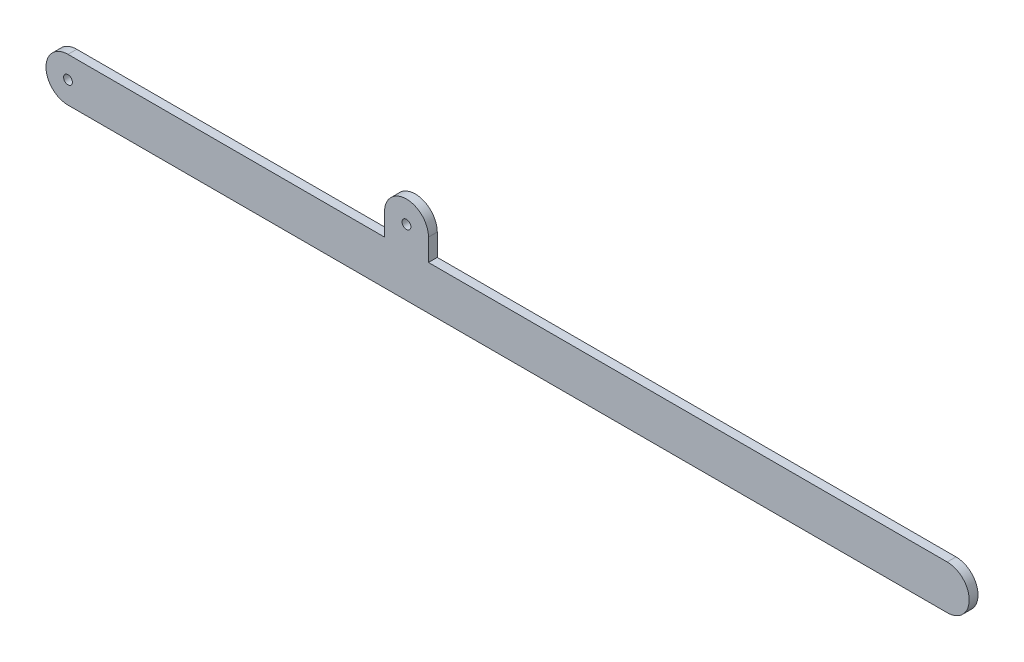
ISO-10303-21;
HEADER;
FILE_DESCRIPTION(('STEP AP214'),'2;1');
FILE_NAME('part.step','',(''),(''),'','','');
FILE_SCHEMA(('AUTOMOTIVE_DESIGN { 1 0 10303 214 1 1 1 1 }'));
ENDSEC;
DATA;
#1=APPLICATION_CONTEXT('core data for automotive mechanical design processes');
#2=APPLICATION_PROTOCOL_DEFINITION('international standard','automotive_design',2000,#1);
#3=PRODUCT_CONTEXT('',#1,'mechanical');
#4=PRODUCT('Part','Part','',(#3));
#5=PRODUCT_RELATED_PRODUCT_CATEGORY('part','',(#4));
#6=PRODUCT_DEFINITION_FORMATION('','',#4);
#7=PRODUCT_DEFINITION_CONTEXT('part definition',#1,'design');
#8=PRODUCT_DEFINITION('design','',#6,#7);
#9=PRODUCT_DEFINITION_SHAPE('','',#8);
#10=(LENGTH_UNIT() NAMED_UNIT(*) SI_UNIT(.MILLI.,.METRE.));
#11=(NAMED_UNIT(*) PLANE_ANGLE_UNIT() SI_UNIT($,.RADIAN.));
#12=(NAMED_UNIT(*) SI_UNIT($,.STERADIAN.) SOLID_ANGLE_UNIT());
#13=UNCERTAINTY_MEASURE_WITH_UNIT(LENGTH_MEASURE(1.E-05),#10,'distance_accuracy_value','');
#14=(GEOMETRIC_REPRESENTATION_CONTEXT(3) GLOBAL_UNCERTAINTY_ASSIGNED_CONTEXT((#13)) GLOBAL_UNIT_ASSIGNED_CONTEXT((#10,
#11,#12)) REPRESENTATION_CONTEXT('',''));
#15=CARTESIAN_POINT('',(0.,0.,0.));
#16=DIRECTION('',(0.,0.,1.));
#17=DIRECTION('',(1.,0.,0.));
#18=AXIS2_PLACEMENT_3D('',#15,#16,#17);
#19=CARTESIAN_POINT('',(0.,-25.,10.));
#20=DIRECTION('',(0.,1.,0.));
#21=DIRECTION('',(0.,0.,1.));
#22=AXIS2_PLACEMENT_3D('',#19,#20,#21);
#23=PLANE('',#22);
#24=DIRECTION('',(1.,0.,0.));
#25=VECTOR('',#24,1.);
#26=CARTESIAN_POINT('',(0.,-25.,0.));
#27=LINE('',#26,#25);
#28=CARTESIAN_POINT('',(0.,-25.,0.));
#29=VERTEX_POINT('',#28);
#30=CARTESIAN_POINT('',(1000.,-25.,0.));
#31=VERTEX_POINT('',#30);
#32=EDGE_CURVE('E126',#29,#31,#27,.T.);
#33=ORIENTED_EDGE('',*,*,#32,.T.);
#34=DIRECTION('',(0.,0.,-1.));
#35=VECTOR('',#34,1.);
#36=CARTESIAN_POINT('',(1000.,-25.,10.));
#37=LINE('',#36,#35);
#38=CARTESIAN_POINT('',(1000.,-25.,10.));
#39=VERTEX_POINT('',#38);
#40=EDGE_CURVE('E11',#39,#31,#37,.T.);
#41=ORIENTED_EDGE('',*,*,#40,.F.);
#42=DIRECTION('',(1.,0.,0.));
#43=VECTOR('',#42,1.);
#44=CARTESIAN_POINT('',(0.,-25.,10.));
#45=LINE('',#44,#43);
#46=CARTESIAN_POINT('',(0.,-25.,10.));
#47=VERTEX_POINT('',#46);
#48=EDGE_CURVE('E145',#47,#39,#45,.T.);
#49=ORIENTED_EDGE('',*,*,#48,.F.);
#50=DIRECTION('',(0.,0.,-1.));
#51=VECTOR('',#50,1.);
#52=CARTESIAN_POINT('',(0.,-25.,10.));
#53=LINE('',#52,#51);
#54=EDGE_CURVE('E122',#47,#29,#53,.T.);
#55=ORIENTED_EDGE('',*,*,#54,.T.);
#56=EDGE_LOOP('',(#33,#41,#49,#55));
#57=FACE_BOUND('',#56,.T.);
#58=ADVANCED_FACE('F32',(#57),#23,.F.);
#59=CARTESIAN_POINT('',(1000.,0.,10.));
#60=DIRECTION('',(0.,0.,-1.));
#61=DIRECTION('',(-1.,0.,0.));
#62=AXIS2_PLACEMENT_3D('',#59,#60,#61);
#63=CYLINDRICAL_SURFACE('',#62,25.);
#64=CARTESIAN_POINT('',(1000.,0.,0.));
#65=DIRECTION('',(0.,0.,1.));
#66=DIRECTION('',(1.,0.,0.));
#67=AXIS2_PLACEMENT_3D('',#64,#65,#66);
#68=CIRCLE('',#67,25.);
#69=CARTESIAN_POINT('',(1000.,25.,0.));
#70=VERTEX_POINT('',#69);
#71=EDGE_CURVE('E129',#31,#70,#68,.T.);
#72=ORIENTED_EDGE('',*,*,#71,.T.);
#73=DIRECTION('',(0.,0.,-1.));
#74=VECTOR('',#73,1.);
#75=CARTESIAN_POINT('',(1000.,25.,10.));
#76=LINE('',#75,#74);
#77=CARTESIAN_POINT('',(1000.,25.,10.));
#78=VERTEX_POINT('',#77);
#79=EDGE_CURVE('E40',#78,#70,#76,.T.);
#80=ORIENTED_EDGE('',*,*,#79,.F.);
#81=CARTESIAN_POINT('',(1000.,0.,10.));
#82=DIRECTION('',(0.,0.,1.));
#83=DIRECTION('',(1.,0.,0.));
#84=AXIS2_PLACEMENT_3D('',#81,#82,#83);
#85=CIRCLE('',#84,25.);
#86=EDGE_CURVE('E87',#39,#78,#85,.T.);
#87=ORIENTED_EDGE('',*,*,#86,.F.);
#88=ORIENTED_EDGE('',*,*,#40,.T.);
#89=EDGE_LOOP('',(#72,#80,#87,#88));
#90=FACE_BOUND('',#89,.T.);
#91=ADVANCED_FACE('F159',(#90),#63,.T.);
#92=CARTESIAN_POINT('',(0.,25.,10.));
#93=DIRECTION('',(0.,1.,0.));
#94=DIRECTION('',(0.,0.,1.));
#95=AXIS2_PLACEMENT_3D('',#92,#93,#94);
#96=PLANE('',#95);
#97=DIRECTION('',(1.,0.,0.));
#98=VECTOR('',#97,1.);
#99=CARTESIAN_POINT('',(0.,25.,0.));
#100=LINE('',#99,#98);
#101=CARTESIAN_POINT('',(410.,25.,0.));
#102=VERTEX_POINT('',#101);
#103=EDGE_CURVE('E133',#102,#70,#100,.T.);
#104=ORIENTED_EDGE('',*,*,#103,.F.);
#105=DIRECTION('',(0.,0.,-1.));
#106=VECTOR('',#105,1.);
#107=CARTESIAN_POINT('',(410.,25.,10.));
#108=LINE('',#107,#106);
#109=CARTESIAN_POINT('',(410.,25.,10.));
#110=VERTEX_POINT('',#109);
#111=EDGE_CURVE('E152',#110,#102,#108,.T.);
#112=ORIENTED_EDGE('',*,*,#111,.F.);
#113=DIRECTION('',(1.,0.,0.));
#114=VECTOR('',#113,1.);
#115=CARTESIAN_POINT('',(0.,25.,10.));
#116=LINE('',#115,#114);
#117=EDGE_CURVE('E158',#110,#78,#116,.T.);
#118=ORIENTED_EDGE('',*,*,#117,.T.);
#119=ORIENTED_EDGE('',*,*,#79,.T.);
#120=EDGE_LOOP('',(#104,#112,#118,#119));
#121=FACE_BOUND('',#120,.T.);
#122=ADVANCED_FACE('F156',(#121),#96,.T.);
#123=CARTESIAN_POINT('',(410.,0.,10.));
#124=DIRECTION('',(-1.,0.,0.));
#125=DIRECTION('',(0.,0.,1.));
#126=AXIS2_PLACEMENT_3D('',#123,#124,#125);
#127=PLANE('',#126);
#128=DIRECTION('',(0.,1.,0.));
#129=VECTOR('',#128,1.);
#130=CARTESIAN_POINT('',(410.,0.,0.));
#131=LINE('',#130,#129);
#132=CARTESIAN_POINT('',(410.,50.,0.));
#133=VERTEX_POINT('',#132);
#134=EDGE_CURVE('E136',#102,#133,#131,.T.);
#135=ORIENTED_EDGE('',*,*,#134,.T.);
#136=DIRECTION('',(0.,0.,-1.));
#137=VECTOR('',#136,1.);
#138=CARTESIAN_POINT('',(410.,50.,10.));
#139=LINE('',#138,#137);
#140=CARTESIAN_POINT('',(410.,50.,10.));
#141=VERTEX_POINT('',#140);
#142=EDGE_CURVE('E149',#141,#133,#139,.T.);
#143=ORIENTED_EDGE('',*,*,#142,.F.);
#144=DIRECTION('',(0.,1.,0.));
#145=VECTOR('',#144,1.);
#146=CARTESIAN_POINT('',(410.,0.,10.));
#147=LINE('',#146,#145);
#148=EDGE_CURVE('E172',#110,#141,#147,.T.);
#149=ORIENTED_EDGE('',*,*,#148,.F.);
#150=ORIENTED_EDGE('',*,*,#111,.T.);
#151=EDGE_LOOP('',(#135,#143,#149,#150));
#152=FACE_BOUND('',#151,.T.);
#153=ADVANCED_FACE('F168',(#152),#127,.F.);
#154=CARTESIAN_POINT('',(385.,50.,10.));
#155=DIRECTION('',(0.,0.,-1.));
#156=DIRECTION('',(-1.,0.,0.));
#157=AXIS2_PLACEMENT_3D('',#154,#155,#156);
#158=CYLINDRICAL_SURFACE('',#157,25.);
#159=CARTESIAN_POINT('',(385.,50.,0.));
#160=DIRECTION('',(0.,0.,1.));
#161=DIRECTION('',(1.,0.,0.));
#162=AXIS2_PLACEMENT_3D('',#159,#160,#161);
#163=CIRCLE('',#162,25.);
#164=CARTESIAN_POINT('',(360.,50.,0.));
#165=VERTEX_POINT('',#164);
#166=EDGE_CURVE('E138',#133,#165,#163,.T.);
#167=ORIENTED_EDGE('',*,*,#166,.T.);
#168=DIRECTION('',(0.,0.,-1.));
#169=VECTOR('',#168,1.);
#170=CARTESIAN_POINT('',(360.,50.,10.));
#171=LINE('',#170,#169);
#172=CARTESIAN_POINT('',(360.,50.,10.));
#173=VERTEX_POINT('',#172);
#174=EDGE_CURVE('E112',#173,#165,#171,.T.);
#175=ORIENTED_EDGE('',*,*,#174,.F.);
#176=CARTESIAN_POINT('',(385.,50.,10.));
#177=DIRECTION('',(0.,0.,1.));
#178=DIRECTION('',(1.,0.,0.));
#179=AXIS2_PLACEMENT_3D('',#176,#177,#178);
#180=CIRCLE('',#179,25.);
#181=EDGE_CURVE('E117',#141,#173,#180,.T.);
#182=ORIENTED_EDGE('',*,*,#181,.F.);
#183=ORIENTED_EDGE('',*,*,#142,.T.);
#184=EDGE_LOOP('',(#167,#175,#182,#183));
#185=FACE_BOUND('',#184,.T.);
#186=ADVANCED_FACE('F171',(#185),#158,.T.);
#187=CARTESIAN_POINT('',(360.,0.,10.));
#188=DIRECTION('',(-1.,0.,0.));
#189=DIRECTION('',(0.,0.,1.));
#190=AXIS2_PLACEMENT_3D('',#187,#188,#189);
#191=PLANE('',#190);
#192=DIRECTION('',(0.,1.,0.));
#193=VECTOR('',#192,1.);
#194=CARTESIAN_POINT('',(360.,0.,0.));
#195=LINE('',#194,#193);
#196=CARTESIAN_POINT('',(360.,25.,0.));
#197=VERTEX_POINT('',#196);
#198=EDGE_CURVE('E107',#197,#165,#195,.T.);
#199=ORIENTED_EDGE('',*,*,#198,.F.);
#200=DIRECTION('',(0.,0.,-1.));
#201=VECTOR('',#200,1.);
#202=CARTESIAN_POINT('',(360.,25.,10.));
#203=LINE('',#202,#201);
#204=CARTESIAN_POINT('',(360.,25.,10.));
#205=VERTEX_POINT('',#204);
#206=EDGE_CURVE('E102',#205,#197,#203,.T.);
#207=ORIENTED_EDGE('',*,*,#206,.F.);
#208=DIRECTION('',(0.,1.,0.));
#209=VECTOR('',#208,1.);
#210=CARTESIAN_POINT('',(360.,0.,10.));
#211=LINE('',#210,#209);
#212=EDGE_CURVE('E105',#205,#173,#211,.T.);
#213=ORIENTED_EDGE('',*,*,#212,.T.);
#214=ORIENTED_EDGE('',*,*,#174,.T.);
#215=EDGE_LOOP('',(#199,#207,#213,#214));
#216=FACE_BOUND('',#215,.T.);
#217=ADVANCED_FACE('F104',(#216),#191,.T.);
#218=CARTESIAN_POINT('',(0.,25.,10.));
#219=DIRECTION('',(0.,1.,0.));
#220=DIRECTION('',(0.,0.,1.));
#221=AXIS2_PLACEMENT_3D('',#218,#219,#220);
#222=PLANE('',#221);
#223=DIRECTION('',(1.,0.,0.));
#224=VECTOR('',#223,1.);
#225=CARTESIAN_POINT('',(0.,25.,0.));
#226=LINE('',#225,#224);
#227=CARTESIAN_POINT('',(0.,25.,0.));
#228=VERTEX_POINT('',#227);
#229=EDGE_CURVE('E142',#228,#197,#226,.T.);
#230=ORIENTED_EDGE('',*,*,#229,.F.);
#231=DIRECTION('',(0.,0.,-1.));
#232=VECTOR('',#231,1.);
#233=CARTESIAN_POINT('',(0.,25.,10.));
#234=LINE('',#233,#232);
#235=CARTESIAN_POINT('',(0.,25.,10.));
#236=VERTEX_POINT('',#235);
#237=EDGE_CURVE('E76',#236,#228,#234,.T.);
#238=ORIENTED_EDGE('',*,*,#237,.F.);
#239=DIRECTION('',(1.,0.,0.));
#240=VECTOR('',#239,1.);
#241=CARTESIAN_POINT('',(0.,25.,10.));
#242=LINE('',#241,#240);
#243=EDGE_CURVE('E115',#236,#205,#242,.T.);
#244=ORIENTED_EDGE('',*,*,#243,.T.);
#245=ORIENTED_EDGE('',*,*,#206,.T.);
#246=EDGE_LOOP('',(#230,#238,#244,#245));
#247=FACE_BOUND('',#246,.T.);
#248=ADVANCED_FACE('F120',(#247),#222,.T.);
#249=CARTESIAN_POINT('',(0.,0.,10.));
#250=DIRECTION('',(0.,0.,-1.));
#251=DIRECTION('',(-1.,0.,0.));
#252=AXIS2_PLACEMENT_3D('',#249,#250,#251);
#253=CYLINDRICAL_SURFACE('',#252,25.);
#254=CARTESIAN_POINT('',(0.,0.,0.));
#255=DIRECTION('',(0.,0.,1.));
#256=DIRECTION('',(1.,0.,0.));
#257=AXIS2_PLACEMENT_3D('',#254,#255,#256);
#258=CIRCLE('',#257,25.);
#259=EDGE_CURVE('E79',#228,#29,#258,.T.);
#260=ORIENTED_EDGE('',*,*,#259,.T.);
#261=ORIENTED_EDGE('',*,*,#54,.F.);
#262=CARTESIAN_POINT('',(0.,0.,10.));
#263=DIRECTION('',(0.,0.,1.));
#264=DIRECTION('',(1.,0.,0.));
#265=AXIS2_PLACEMENT_3D('',#262,#263,#264);
#266=CIRCLE('',#265,25.);
#267=EDGE_CURVE('E48',#236,#47,#266,.T.);
#268=ORIENTED_EDGE('',*,*,#267,.F.);
#269=ORIENTED_EDGE('',*,*,#237,.T.);
#270=EDGE_LOOP('',(#260,#261,#268,#269));
#271=FACE_BOUND('',#270,.T.);
#272=ADVANCED_FACE('F201',(#271),#253,.T.);
#273=CARTESIAN_POINT('',(0.,0.,10.));
#274=DIRECTION('',(0.,0.,1.));
#275=DIRECTION('',(1.,0.,0.));
#276=AXIS2_PLACEMENT_3D('',#273,#274,#275);
#277=PLANE('',#276);
#278=CARTESIAN_POINT('',(0.,0.,10.));
#279=DIRECTION('',(0.,0.,1.));
#280=DIRECTION('',(1.,0.,0.));
#281=AXIS2_PLACEMENT_3D('',#278,#279,#280);
#282=CIRCLE('',#281,5.);
#283=CARTESIAN_POINT('',(5.,0.,10.));
#284=VERTEX_POINT('',#283);
#285=EDGE_CURVE('E184',#284,#284,#282,.T.);
#286=ORIENTED_EDGE('',*,*,#285,.F.);
#287=EDGE_LOOP('',(#286));
#288=FACE_BOUND('',#287,.T.);
#289=CARTESIAN_POINT('',(385.,50.,10.));
#290=DIRECTION('',(0.,0.,1.));
#291=DIRECTION('',(1.,0.,0.));
#292=AXIS2_PLACEMENT_3D('',#289,#290,#291);
#293=CIRCLE('',#292,4.99999999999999);
#294=CARTESIAN_POINT('',(390.,50.,10.));
#295=VERTEX_POINT('',#294);
#296=EDGE_CURVE('E178',#295,#295,#293,.T.);
#297=ORIENTED_EDGE('',*,*,#296,.F.);
#298=EDGE_LOOP('',(#297));
#299=FACE_BOUND('',#298,.T.);
#300=ORIENTED_EDGE('',*,*,#48,.T.);
#301=ORIENTED_EDGE('',*,*,#86,.T.);
#302=ORIENTED_EDGE('',*,*,#117,.F.);
#303=ORIENTED_EDGE('',*,*,#148,.T.);
#304=ORIENTED_EDGE('',*,*,#181,.T.);
#305=ORIENTED_EDGE('',*,*,#212,.F.);
#306=ORIENTED_EDGE('',*,*,#243,.F.);
#307=ORIENTED_EDGE('',*,*,#267,.T.);
#308=EDGE_LOOP('',(#300,#301,#302,#303,#304,#305,#306,#307));
#309=FACE_BOUND('',#308,.T.);
#310=ADVANCED_FACE('F114',(#288,#299,#309),#277,.T.);
#311=CARTESIAN_POINT('',(0.,0.,0.));
#312=DIRECTION('',(0.,0.,1.));
#313=DIRECTION('',(1.,0.,0.));
#314=AXIS2_PLACEMENT_3D('',#311,#312,#313);
#315=PLANE('',#314);
#316=CARTESIAN_POINT('',(0.,0.,0.));
#317=DIRECTION('',(0.,0.,1.));
#318=DIRECTION('',(1.,0.,0.));
#319=AXIS2_PLACEMENT_3D('',#316,#317,#318);
#320=CIRCLE('',#319,5.);
#321=CARTESIAN_POINT('',(5.,0.,0.));
#322=VERTEX_POINT('',#321);
#323=EDGE_CURVE('E130',#322,#322,#320,.T.);
#324=ORIENTED_EDGE('',*,*,#323,.T.);
#325=EDGE_LOOP('',(#324));
#326=FACE_BOUND('',#325,.T.);
#327=CARTESIAN_POINT('',(385.,50.,0.));
#328=DIRECTION('',(0.,0.,1.));
#329=DIRECTION('',(1.,0.,0.));
#330=AXIS2_PLACEMENT_3D('',#327,#328,#329);
#331=CIRCLE('',#330,4.99999999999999);
#332=CARTESIAN_POINT('',(390.,50.,0.));
#333=VERTEX_POINT('',#332);
#334=EDGE_CURVE('E181',#333,#333,#331,.T.);
#335=ORIENTED_EDGE('',*,*,#334,.T.);
#336=EDGE_LOOP('',(#335));
#337=FACE_BOUND('',#336,.T.);
#338=ORIENTED_EDGE('',*,*,#32,.F.);
#339=ORIENTED_EDGE('',*,*,#259,.F.);
#340=ORIENTED_EDGE('',*,*,#229,.T.);
#341=ORIENTED_EDGE('',*,*,#198,.T.);
#342=ORIENTED_EDGE('',*,*,#166,.F.);
#343=ORIENTED_EDGE('',*,*,#134,.F.);
#344=ORIENTED_EDGE('',*,*,#103,.T.);
#345=ORIENTED_EDGE('',*,*,#71,.F.);
#346=EDGE_LOOP('',(#338,#339,#340,#341,#342,#343,#344,#345));
#347=FACE_BOUND('',#346,.T.);
#348=ADVANCED_FACE('F164',(#326,#337,#347),#315,.F.);
#349=CARTESIAN_POINT('',(385.,50.,0.));
#350=DIRECTION('',(0.,0.,1.));
#351=DIRECTION('',(1.,0.,0.));
#352=AXIS2_PLACEMENT_3D('',#349,#350,#351);
#353=CYLINDRICAL_SURFACE('',#352,4.99999999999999);
#354=ORIENTED_EDGE('',*,*,#334,.F.);
#355=EDGE_LOOP('',(#354));
#356=FACE_BOUND('',#355,.T.);
#357=ORIENTED_EDGE('',*,*,#296,.T.);
#358=EDGE_LOOP('',(#357));
#359=FACE_BOUND('',#358,.T.);
#360=ADVANCED_FACE('F195',(#356,#359),#353,.F.);
#361=CARTESIAN_POINT('',(0.,0.,0.));
#362=DIRECTION('',(0.,0.,1.));
#363=DIRECTION('',(1.,0.,0.));
#364=AXIS2_PLACEMENT_3D('',#361,#362,#363);
#365=CYLINDRICAL_SURFACE('',#364,5.);
#366=ORIENTED_EDGE('',*,*,#323,.F.);
#367=EDGE_LOOP('',(#366));
#368=FACE_BOUND('',#367,.T.);
#369=ORIENTED_EDGE('',*,*,#285,.T.);
#370=EDGE_LOOP('',(#369));
#371=FACE_BOUND('',#370,.T.);
#372=ADVANCED_FACE('F192',(#368,#371),#365,.F.);
#373=CLOSED_SHELL('',(#58,#91,#122,#153,#186,#217,#248,#272,#310,#348,#360,#372));
#374=MANIFOLD_SOLID_BREP('B2',#373);
#375=ADVANCED_BREP_SHAPE_REPRESENTATION('',(#18,#374),#14);
#376=SHAPE_DEFINITION_REPRESENTATION(#9,#375);
ENDSEC;
END-ISO-10303-21;
